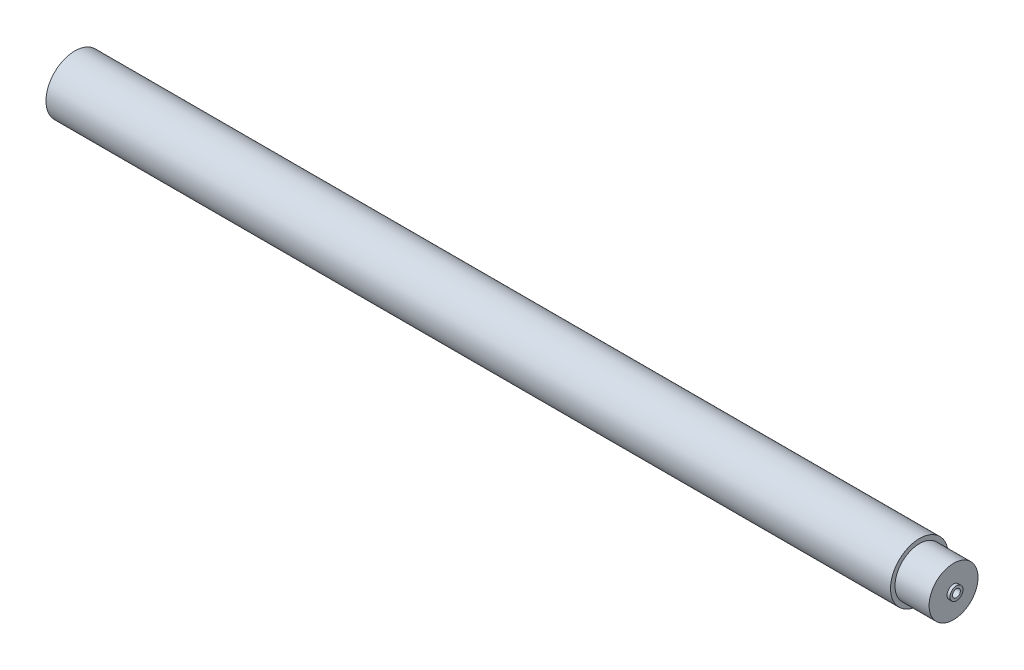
from build123d import *

# Parameters (mm, degrees)
ESQUISSE1_R             = 44.5
EXTRUSION1_DEPTH        = 1300
ESQUISSE2_R             = 10
EXTRUSION2_DEPTH        = 3
ESQUISSE3_R             = 37.65
EXTRUSION3_DEPTH        = 52.5
EXTRUSION4_START        = 4.5
ESQUISSE4_R             = 10
EXTRUSION4_DEPTH        = 4.5
ESQUISSE6_R             = 5
ENL_V_MAT_EXTRU_1_DEPTH = 30
ESQUISSE7_R             = 6
ENL_V_MAT_EXTRU_2_DEPTH = 30


with BuildPart() as part:
    # Esquisse1 → Extrusion1 (new body)
    with BuildSketch(Plane(origin=(0, 0, 0), x_dir=(0, 0, -1), z_dir=(1, 0, 0))):
        Circle(ESQUISSE1_R)
    extrude(amount=EXTRUSION1_DEPTH)

    # Esquisse2 → Extrusion2 (add)
    with BuildSketch(Plane.ZY):
        with Locations(Location((0, 0, 0), (0, 0, 180))):
            Circle(ESQUISSE2_R)
    extrude(amount=EXTRUSION2_DEPTH)

    # Esquisse3 → Extrusion3 (add)
    with BuildSketch(Plane(origin=(1300, 0, 0), x_dir=(0, 0, -1), z_dir=(1, 0, 0))):
        Circle(ESQUISSE3_R)
    extrude(amount=EXTRUSION3_DEPTH)

    # Esquisse4 → Extrusion4 (add)
    with BuildSketch(Plane(origin=(1352.5, 0, 0), x_dir=(0, 0, -1), z_dir=(1, 0, 0)).offset(EXTRUSION4_START)):
        Circle(ESQUISSE4_R)
    extrude(amount=-EXTRUSION4_DEPTH)

    # Esquisse6 → Enl_v. mat.-Extru.1 (cut)
    with BuildSketch(Plane.ZY.offset(3)):
        Circle(ESQUISSE6_R)
    extrude(amount=-ENL_V_MAT_EXTRU_1_DEPTH, mode=Mode.SUBTRACT)

    # Esquisse7 → Enl_v. mat.-Extru.2 (cut)
    with BuildSketch(Plane(origin=(1357, 0, 0), x_dir=(0, 0, -1), z_dir=(1, 0, 0))):
        Circle(ESQUISSE7_R)
    extrude(amount=-ENL_V_MAT_EXTRU_2_DEPTH, mode=Mode.SUBTRACT)


solid = part.part
